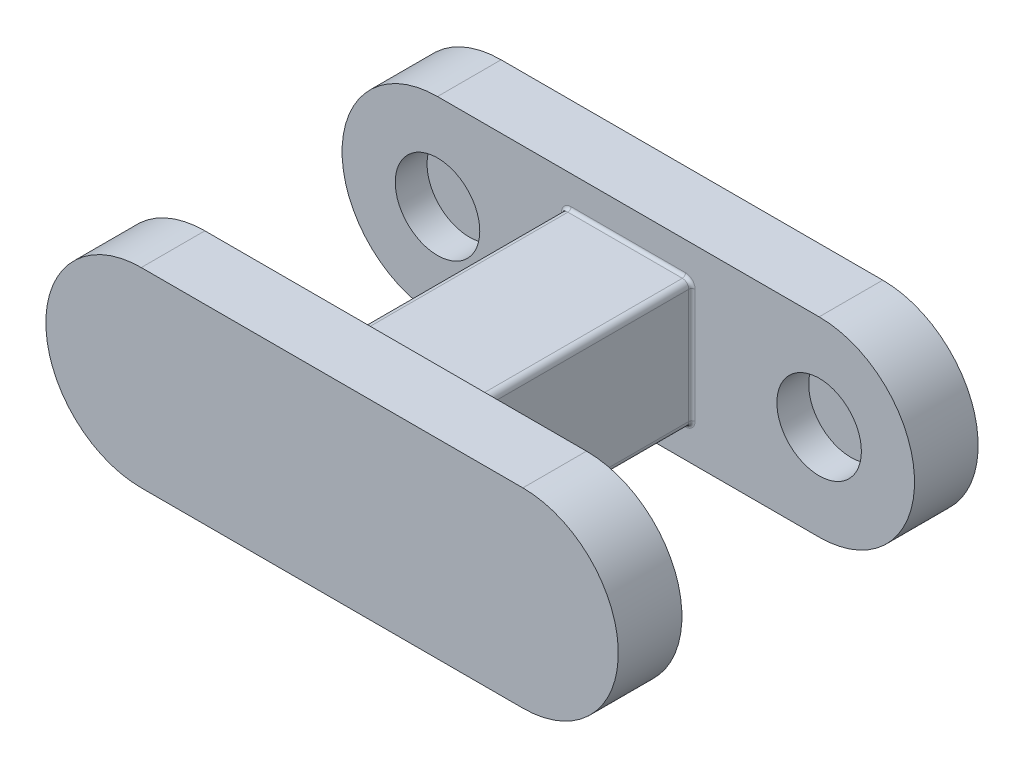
from build123d import *

# Parameters (mm, degrees)
BOSS_EXTRUDE1_DEPTH = 25.4
SKETCH4_R           = 16.875
CUT_EXTRUDE1_DEPTH  = 12.7
SKETCH5_W           = 50.8
SKETCH5_H           = 50.8
BOSS_EXTRUDE2_DEPTH = 92.9
FILLET1_R           = 2.54
FILLET2_R           = 1.27
FILLET3_R           = 1.27


with BuildPart() as part:
    # Sketch1 → Boss-Extrude1 (new body)
    with BuildSketch(Plane.XY):
        with BuildLine():
            Line((-76.2, 38.1), (76.2, 38.1))
            ThreePointArc((76.2, 38.1), (114.3, 0), (76.2, -38.1))
            Line((76.2, -38.1), (-76.2, -38.1))
            ThreePointArc((-76.2, -38.1), (-114.3, 0), (-76.2, 38.1))
        make_face()
    boss_extrude1 = extrude(amount=BOSS_EXTRUDE1_DEPTH)

    # Sketch4 → Cut-Extrude1 (cut)
    with BuildSketch(Plane.XY.offset(25.4)):
        with Locations((76.2, 0)):
            Circle(SKETCH4_R)
        with Locations((-76.2, 0)):
            Circle(SKETCH4_R)
    cut_extrude1 = extrude(amount=-CUT_EXTRUDE1_DEPTH, mode=Mode.SUBTRACT)

    # Sketch5 → Boss-Extrude2 (add)
    with BuildSketch(Plane.XY.offset(25.4)):
        Rectangle(SKETCH5_W, SKETCH5_H)
    extrude(amount=BOSS_EXTRUDE2_DEPTH)

    # Mirror2: Boss-Extrude1, Cut-Extrude1 across plane
    add(boss_extrude1.mirror(Plane.XY.offset(71.85)))
    add(cut_extrude1.mirror(Plane.XY.offset(71.85)), mode=Mode.SUBTRACT)

    # Fillet1
    fillet1_edges = [part.edges().sort_by_distance(p)[0] for p in [
        (25.4, -25.4, 71.85),
        (25.4, 25.4, 71.85),
        (-25.4, 25.4, 71.85),
        (-25.4, -25.4, 71.85),
    ]]
    fillet(fillet1_edges, radius=FILLET1_R)

    # Fillet2
    fillet2_edges = [part.edges().sort_by_distance(p)[0] for p in [
        (0, 25.4, 25.4),
        (25.4, 0, 25.4),
        (0, -25.4, 25.4),
        (-25.4, 0, 25.4),
        (24.656051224, 24.656051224, 25.4),
        (24.656051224, -24.656051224, 25.4),
        (-24.656051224, -24.656051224, 25.4),
        (-24.656051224, 24.656051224, 25.4),
    ]]
    fillet(fillet2_edges, radius=FILLET2_R)

    # Fillet3
    fillet3_edges = [part.edges().sort_by_distance(p)[0] for p in [
        (0, 25.4, 118.3),
        (25.4, 0, 118.3),
        (0, -25.4, 118.3),
        (-25.4, 0, 118.3),
        (24.656051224, 24.656051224, 118.3),
        (24.656051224, -24.656051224, 118.3),
        (-24.656051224, -24.656051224, 118.3),
        (-24.656051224, 24.656051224, 118.3),
    ]]
    fillet(fillet3_edges, radius=FILLET3_R)


solid = part.part
